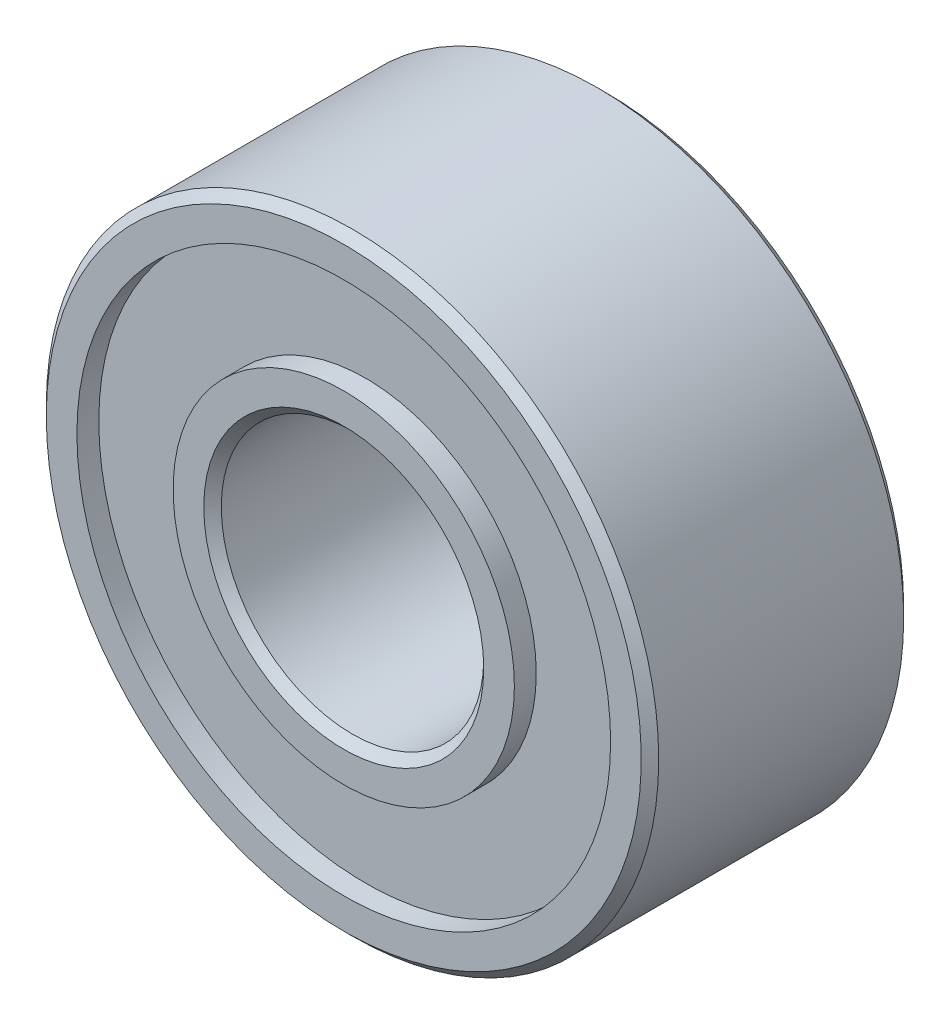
from build123d import *

# Parameters (mm, degrees)
FASE1_SIZE = 0.1


with BuildPart() as part:
    # Skizze2 → Rotation1 (revolve)
    with BuildSketch(Plane(origin=(0, 0, 0), x_dir=(0, 0, -1), z_dir=(1, 0, 0)), mode=Mode.PRIVATE) as rotation1_sk:
        Polygon((-1.5, 1.5), (1.5, 1.5), (1.5, 1.95), (1.25, 1.95), (1.25, 3.05), (1.5, 3.05), (1.5, 3.5), (-1.5, 3.5), (-1.5, 3.05), (-1.25, 3.05), (-1.25, 1.95), (-1.5, 1.95), align=None)
    revolve(rotation1_sk.sketch.rotate(Axis((0, 0, 11.845846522), (0, 0, -1)), 90), axis=Axis((0, 0, 11.845846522), (0, 0, -1)))

    # Fase1
    fase1_edges = [part.edges().sort_by_distance(p)[0] for p in [
        (-3.5, 0, 1.5),
        (-3.5, 0, -1.5),
        (-1.5, 0, -1.5),
        (-1.5, 0, 1.5),
    ]]
    chamfer(fase1_edges, length=FASE1_SIZE)


solid = part.part
